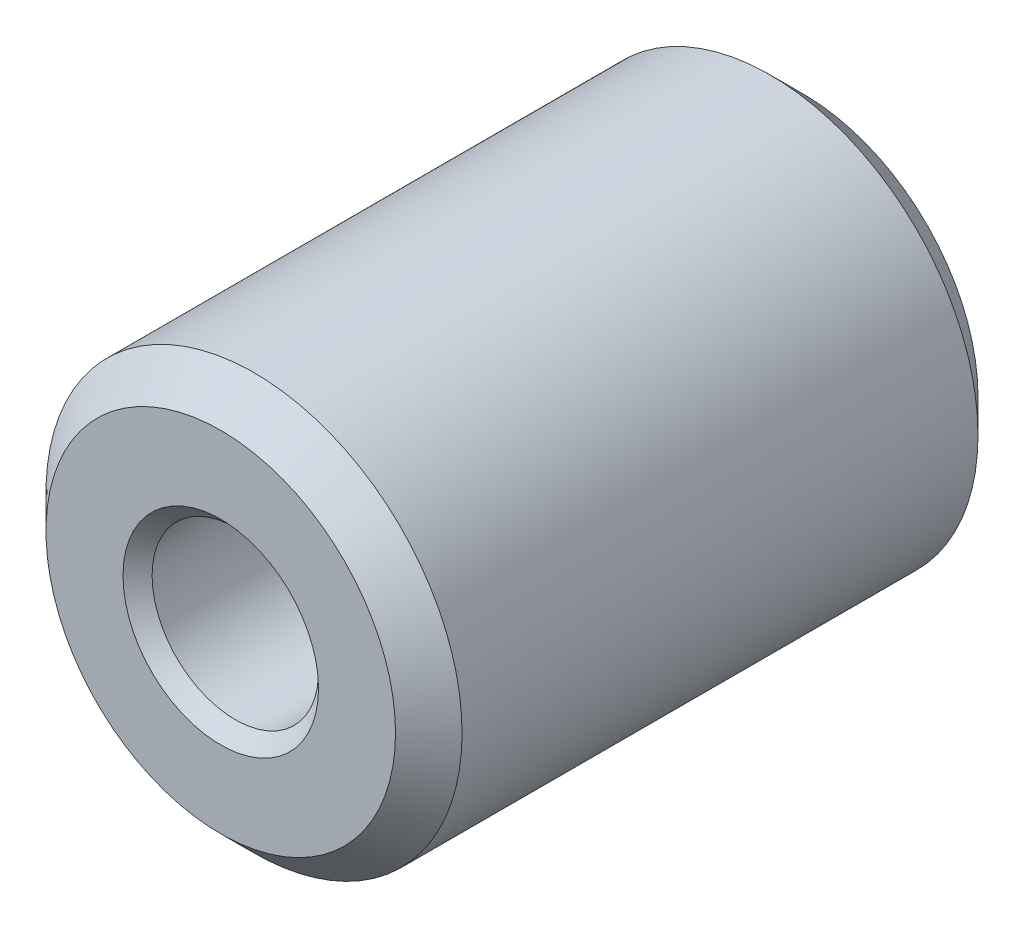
ISO-10303-21;
HEADER;
FILE_DESCRIPTION(('STEP AP214'),'2;1');
FILE_NAME('part.step','',(''),(''),'','','');
FILE_SCHEMA(('AUTOMOTIVE_DESIGN { 1 0 10303 214 1 1 1 1 }'));
ENDSEC;
DATA;
#1=APPLICATION_CONTEXT('core data for automotive mechanical design processes');
#2=APPLICATION_PROTOCOL_DEFINITION('international standard','automotive_design',2000,#1);
#3=PRODUCT_CONTEXT('',#1,'mechanical');
#4=PRODUCT('Part','Part','',(#3));
#5=PRODUCT_RELATED_PRODUCT_CATEGORY('part','',(#4));
#6=PRODUCT_DEFINITION_FORMATION('','',#4);
#7=PRODUCT_DEFINITION_CONTEXT('part definition',#1,'design');
#8=PRODUCT_DEFINITION('design','',#6,#7);
#9=PRODUCT_DEFINITION_SHAPE('','',#8);
#10=(LENGTH_UNIT() NAMED_UNIT(*) SI_UNIT(.MILLI.,.METRE.));
#11=(NAMED_UNIT(*) PLANE_ANGLE_UNIT() SI_UNIT($,.RADIAN.));
#12=(NAMED_UNIT(*) SI_UNIT($,.STERADIAN.) SOLID_ANGLE_UNIT());
#13=UNCERTAINTY_MEASURE_WITH_UNIT(LENGTH_MEASURE(1.E-05),#10,'distance_accuracy_value','');
#14=(GEOMETRIC_REPRESENTATION_CONTEXT(3) GLOBAL_UNCERTAINTY_ASSIGNED_CONTEXT((#13)) GLOBAL_UNIT_ASSIGNED_CONTEXT((#10,
#11,#12)) REPRESENTATION_CONTEXT('',''));
#15=CARTESIAN_POINT('',(0.,0.,0.));
#16=DIRECTION('',(0.,0.,1.));
#17=DIRECTION('',(1.,0.,0.));
#18=AXIS2_PLACEMENT_3D('',#15,#16,#17);
#19=CARTESIAN_POINT('',(0.,0.,14.));
#20=DIRECTION('',(0.,0.,1.));
#21=DIRECTION('',(1.,0.,0.));
#22=AXIS2_PLACEMENT_3D('',#19,#20,#21);
#23=PLANE('',#22);
#24=CARTESIAN_POINT('',(0.,0.,14.));
#25=DIRECTION('',(0.,0.,1.));
#26=DIRECTION('',(1.,0.,0.));
#27=AXIS2_PLACEMENT_3D('',#24,#25,#26);
#28=CIRCLE('',#27,4.2);
#29=CARTESIAN_POINT('',(4.2,0.,14.));
#30=VERTEX_POINT('',#29);
#31=EDGE_CURVE('E19',#30,#30,#28,.T.);
#32=ORIENTED_EDGE('',*,*,#31,.T.);
#33=EDGE_LOOP('',(#32));
#34=FACE_BOUND('',#33,.T.);
#35=CARTESIAN_POINT('',(0.,0.,14.));
#36=DIRECTION('',(0.,0.,-1.));
#37=DIRECTION('',(-1.,0.,0.));
#38=AXIS2_PLACEMENT_3D('',#35,#36,#37);
#39=CIRCLE('',#38,2.35);
#40=CARTESIAN_POINT('',(-2.35,0.,14.));
#41=VERTEX_POINT('',#40);
#42=EDGE_CURVE('E41',#41,#41,#39,.T.);
#43=ORIENTED_EDGE('',*,*,#42,.T.);
#44=EDGE_LOOP('',(#43));
#45=FACE_BOUND('',#44,.T.);
#46=ADVANCED_FACE('F12',(#34,#45),#23,.T.);
#47=CARTESIAN_POINT('',(0.,0.,14.));
#48=DIRECTION('',(0.,0.,-1.));
#49=DIRECTION('',(-1.,0.,0.));
#50=AXIS2_PLACEMENT_3D('',#47,#48,#49);
#51=CYLINDRICAL_SURFACE('',#50,5.);
#52=CARTESIAN_POINT('',(0.,0.,13.2));
#53=DIRECTION('',(0.,0.,1.));
#54=DIRECTION('',(1.,0.,0.));
#55=AXIS2_PLACEMENT_3D('',#52,#53,#54);
#56=CIRCLE('',#55,5.);
#57=CARTESIAN_POINT('',(5.,0.,13.2));
#58=VERTEX_POINT('',#57);
#59=EDGE_CURVE('E8',#58,#58,#56,.F.);
#60=ORIENTED_EDGE('',*,*,#59,.T.);
#61=EDGE_LOOP('',(#60));
#62=FACE_BOUND('',#61,.T.);
#63=CARTESIAN_POINT('',(0.,0.,0.8));
#64=DIRECTION('',(0.,0.,1.));
#65=DIRECTION('',(1.,0.,0.));
#66=AXIS2_PLACEMENT_3D('',#63,#64,#65);
#67=CIRCLE('',#66,5.);
#68=CARTESIAN_POINT('',(5.,0.,0.8));
#69=VERTEX_POINT('',#68);
#70=EDGE_CURVE('E27',#69,#69,#67,.T.);
#71=ORIENTED_EDGE('',*,*,#70,.T.);
#72=EDGE_LOOP('',(#71));
#73=FACE_BOUND('',#72,.T.);
#74=ADVANCED_FACE('F14',(#62,#73),#51,.T.);
#75=CARTESIAN_POINT('',(0.,0.,0.));
#76=DIRECTION('',(0.,0.,1.));
#77=DIRECTION('',(1.,0.,0.));
#78=AXIS2_PLACEMENT_3D('',#75,#76,#77);
#79=PLANE('',#78);
#80=CARTESIAN_POINT('',(0.,0.,0.));
#81=DIRECTION('',(0.,0.,-1.));
#82=DIRECTION('',(-1.,0.,0.));
#83=AXIS2_PLACEMENT_3D('',#80,#81,#82);
#84=CIRCLE('',#83,2.35);
#85=CARTESIAN_POINT('',(-2.35,0.,0.));
#86=VERTEX_POINT('',#85);
#87=EDGE_CURVE('E32',#86,#86,#84,.T.);
#88=ORIENTED_EDGE('',*,*,#87,.F.);
#89=EDGE_LOOP('',(#88));
#90=FACE_BOUND('',#89,.T.);
#91=CARTESIAN_POINT('',(0.,0.,0.));
#92=DIRECTION('',(0.,0.,1.));
#93=DIRECTION('',(1.,0.,0.));
#94=AXIS2_PLACEMENT_3D('',#91,#92,#93);
#95=CIRCLE('',#94,4.2);
#96=CARTESIAN_POINT('',(4.2,0.,0.));
#97=VERTEX_POINT('',#96);
#98=EDGE_CURVE('E23',#97,#97,#95,.F.);
#99=ORIENTED_EDGE('',*,*,#98,.T.);
#100=EDGE_LOOP('',(#99));
#101=FACE_BOUND('',#100,.T.);
#102=ADVANCED_FACE('F65',(#90,#101),#79,.F.);
#103=CARTESIAN_POINT('',(0.,0.,0.8));
#104=DIRECTION('',(0.,0.,1.));
#105=DIRECTION('',(1.,0.,0.));
#106=AXIS2_PLACEMENT_3D('',#103,#104,#105);
#107=CONICAL_SURFACE('',#106,5.,0.78539816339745);
#108=ORIENTED_EDGE('',*,*,#98,.F.);
#109=EDGE_LOOP('',(#108));
#110=FACE_BOUND('',#109,.T.);
#111=ORIENTED_EDGE('',*,*,#70,.F.);
#112=EDGE_LOOP('',(#111));
#113=FACE_BOUND('',#112,.T.);
#114=ADVANCED_FACE('F68',(#110,#113),#107,.T.);
#115=CARTESIAN_POINT('',(0.,0.,14.));
#116=DIRECTION('',(0.,0.,-1.));
#117=DIRECTION('',(-1.,0.,0.));
#118=AXIS2_PLACEMENT_3D('',#115,#116,#117);
#119=CONICAL_SURFACE('',#118,4.2,0.785398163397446);
#120=ORIENTED_EDGE('',*,*,#59,.F.);
#121=EDGE_LOOP('',(#120));
#122=FACE_BOUND('',#121,.T.);
#123=ORIENTED_EDGE('',*,*,#31,.F.);
#124=EDGE_LOOP('',(#123));
#125=FACE_BOUND('',#124,.T.);
#126=ADVANCED_FACE('F61',(#122,#125),#119,.T.);
#127=CARTESIAN_POINT('',(0.,0.,0.));
#128=DIRECTION('',(0.,0.,-1.));
#129=DIRECTION('',(-1.,0.,0.));
#130=AXIS2_PLACEMENT_3D('',#127,#128,#129);
#131=CONICAL_SURFACE('',#130,2.35,0.785398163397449);
#132=CARTESIAN_POINT('',(0.,0.,0.35));
#133=DIRECTION('',(0.,0.,-1.));
#134=DIRECTION('',(-1.,0.,0.));
#135=AXIS2_PLACEMENT_3D('',#132,#133,#134);
#136=CIRCLE('',#135,2.);
#137=CARTESIAN_POINT('',(-2.,0.,0.35));
#138=VERTEX_POINT('',#137);
#139=EDGE_CURVE('E35',#138,#138,#136,.T.);
#140=ORIENTED_EDGE('',*,*,#139,.F.);
#141=EDGE_LOOP('',(#140));
#142=FACE_BOUND('',#141,.T.);
#143=ORIENTED_EDGE('',*,*,#87,.T.);
#144=EDGE_LOOP('',(#143));
#145=FACE_BOUND('',#144,.T.);
#146=ADVANCED_FACE('F55',(#142,#145),#131,.F.);
#147=CARTESIAN_POINT('',(0.,0.,0.));
#148=DIRECTION('',(0.,0.,-1.));
#149=DIRECTION('',(-1.,0.,0.));
#150=AXIS2_PLACEMENT_3D('',#147,#148,#149);
#151=CYLINDRICAL_SURFACE('',#150,2.);
#152=CARTESIAN_POINT('',(0.,0.,13.65));
#153=DIRECTION('',(0.,0.,-1.));
#154=DIRECTION('',(-1.,0.,0.));
#155=AXIS2_PLACEMENT_3D('',#152,#153,#154);
#156=CIRCLE('',#155,2.);
#157=CARTESIAN_POINT('',(-2.,0.,13.65));
#158=VERTEX_POINT('',#157);
#159=EDGE_CURVE('E38',#158,#158,#156,.T.);
#160=ORIENTED_EDGE('',*,*,#159,.F.);
#161=EDGE_LOOP('',(#160));
#162=FACE_BOUND('',#161,.T.);
#163=ORIENTED_EDGE('',*,*,#139,.T.);
#164=EDGE_LOOP('',(#163));
#165=FACE_BOUND('',#164,.T.);
#166=ADVANCED_FACE('F49',(#162,#165),#151,.F.);
#167=CARTESIAN_POINT('',(0.,0.,13.65));
#168=DIRECTION('',(0.,0.,1.));
#169=DIRECTION('',(1.,0.,0.));
#170=AXIS2_PLACEMENT_3D('',#167,#168,#169);
#171=CONICAL_SURFACE('',#170,2.,0.785398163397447);
#172=ORIENTED_EDGE('',*,*,#42,.F.);
#173=EDGE_LOOP('',(#172));
#174=FACE_BOUND('',#173,.T.);
#175=ORIENTED_EDGE('',*,*,#159,.T.);
#176=EDGE_LOOP('',(#175));
#177=FACE_BOUND('',#176,.T.);
#178=ADVANCED_FACE('F46',(#174,#177),#171,.F.);
#179=CLOSED_SHELL('',(#46,#74,#102,#114,#126,#146,#166,#178));
#180=MANIFOLD_SOLID_BREP('B1',#179);
#181=ADVANCED_BREP_SHAPE_REPRESENTATION('',(#18,#180),#14);
#182=SHAPE_DEFINITION_REPRESENTATION(#9,#181);
ENDSEC;
END-ISO-10303-21;
